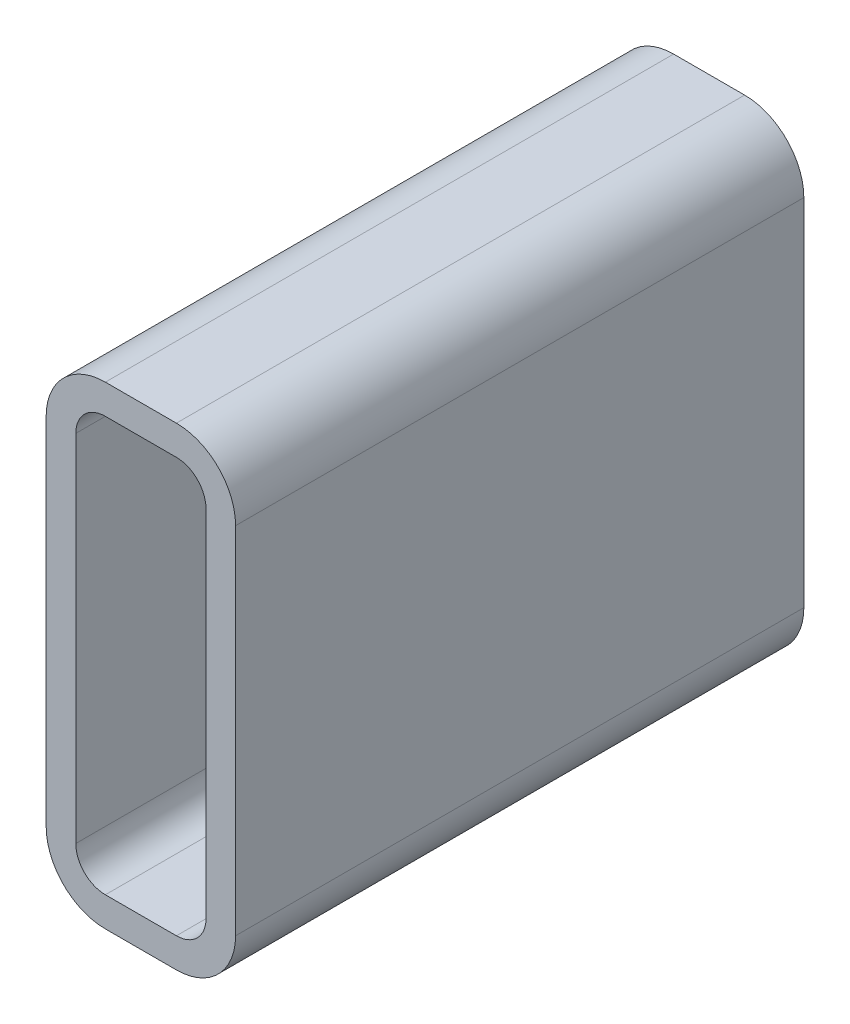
ISO-10303-21;
HEADER;
FILE_DESCRIPTION(('STEP AP214'),'2;1');
FILE_NAME('part.step','',(''),(''),'','','');
FILE_SCHEMA(('AUTOMOTIVE_DESIGN { 1 0 10303 214 1 1 1 1 }'));
ENDSEC;
DATA;
#1=APPLICATION_CONTEXT('core data for automotive mechanical design processes');
#2=APPLICATION_PROTOCOL_DEFINITION('international standard','automotive_design',2000,#1);
#3=PRODUCT_CONTEXT('',#1,'mechanical');
#4=PRODUCT('Part','Part','',(#3));
#5=PRODUCT_RELATED_PRODUCT_CATEGORY('part','',(#4));
#6=PRODUCT_DEFINITION_FORMATION('','',#4);
#7=PRODUCT_DEFINITION_CONTEXT('part definition',#1,'design');
#8=PRODUCT_DEFINITION('design','',#6,#7);
#9=PRODUCT_DEFINITION_SHAPE('','',#8);
#10=(LENGTH_UNIT() NAMED_UNIT(*) SI_UNIT(.MILLI.,.METRE.));
#11=(NAMED_UNIT(*) PLANE_ANGLE_UNIT() SI_UNIT($,.RADIAN.));
#12=(NAMED_UNIT(*) SI_UNIT($,.STERADIAN.) SOLID_ANGLE_UNIT());
#13=UNCERTAINTY_MEASURE_WITH_UNIT(LENGTH_MEASURE(1.E-05),#10,'distance_accuracy_value','');
#14=(GEOMETRIC_REPRESENTATION_CONTEXT(3) GLOBAL_UNCERTAINTY_ASSIGNED_CONTEXT((#13)) GLOBAL_UNIT_ASSIGNED_CONTEXT((#10,
#11,#12)) REPRESENTATION_CONTEXT('',''));
#15=CARTESIAN_POINT('',(0.,0.,0.));
#16=DIRECTION('',(0.,0.,1.));
#17=DIRECTION('',(1.,0.,0.));
#18=AXIS2_PLACEMENT_3D('',#15,#16,#17);
#19=CARTESIAN_POINT('',(33.4251778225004,224.170313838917,304.8));
#20=DIRECTION('',(0.,0.,1.));
#21=DIRECTION('',(1.,0.,0.));
#22=AXIS2_PLACEMENT_3D('',#19,#20,#21);
#23=PLANE('',#22);
#24=CARTESIAN_POINT('',(33.4251778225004,224.170313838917,304.8));
#25=DIRECTION('',(0.,0.,1.));
#26=DIRECTION('',(1.,0.,0.));
#27=AXIS2_PLACEMENT_3D('',#24,#25,#26);
#28=CIRCLE('',#27,31.75);
#29=CARTESIAN_POINT('',(33.4251778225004,255.920313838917,304.8));
#30=VERTEX_POINT('',#29);
#31=CARTESIAN_POINT('',(1.67517782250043,224.170313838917,304.8));
#32=VERTEX_POINT('',#31);
#33=EDGE_CURVE('E211',#30,#32,#28,.T.);
#34=ORIENTED_EDGE('',*,*,#33,.T.);
#35=DIRECTION('',(0.,-1.,0.));
#36=VECTOR('',#35,1.);
#37=CARTESIAN_POINT('',(1.67517782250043,33.6703138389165,304.8));
#38=LINE('',#37,#36);
#39=CARTESIAN_POINT('',(1.67517782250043,33.6703138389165,304.8));
#40=VERTEX_POINT('',#39);
#41=EDGE_CURVE('E214',#32,#40,#38,.T.);
#42=ORIENTED_EDGE('',*,*,#41,.T.);
#43=CARTESIAN_POINT('',(33.4251778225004,33.6703138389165,304.8));
#44=DIRECTION('',(0.,0.,1.));
#45=DIRECTION('',(1.,0.,0.));
#46=AXIS2_PLACEMENT_3D('',#43,#44,#45);
#47=CIRCLE('',#46,31.75);
#48=CARTESIAN_POINT('',(33.4251778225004,1.92031383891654,304.8));
#49=VERTEX_POINT('',#48);
#50=EDGE_CURVE('E217',#40,#49,#47,.T.);
#51=ORIENTED_EDGE('',*,*,#50,.T.);
#52=DIRECTION('',(1.,0.,0.));
#53=VECTOR('',#52,1.);
#54=CARTESIAN_POINT('',(71.5251778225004,1.92031383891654,304.8));
#55=LINE('',#54,#53);
#56=CARTESIAN_POINT('',(71.5251778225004,1.92031383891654,304.8));
#57=VERTEX_POINT('',#56);
#58=EDGE_CURVE('E219',#49,#57,#55,.T.);
#59=ORIENTED_EDGE('',*,*,#58,.T.);
#60=CARTESIAN_POINT('',(71.5251778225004,33.6703138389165,304.8));
#61=DIRECTION('',(0.,0.,1.));
#62=DIRECTION('',(1.,0.,0.));
#63=AXIS2_PLACEMENT_3D('',#60,#61,#62);
#64=CIRCLE('',#63,31.75);
#65=CARTESIAN_POINT('',(103.2751778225,33.6703138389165,304.8));
#66=VERTEX_POINT('',#65);
#67=EDGE_CURVE('E221',#57,#66,#64,.T.);
#68=ORIENTED_EDGE('',*,*,#67,.T.);
#69=DIRECTION('',(0.,1.,0.));
#70=VECTOR('',#69,1.);
#71=CARTESIAN_POINT('',(103.2751778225,224.170313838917,304.8));
#72=LINE('',#71,#70);
#73=CARTESIAN_POINT('',(103.2751778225,224.170313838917,304.8));
#74=VERTEX_POINT('',#73);
#75=EDGE_CURVE('E223',#66,#74,#72,.T.);
#76=ORIENTED_EDGE('',*,*,#75,.T.);
#77=CARTESIAN_POINT('',(71.5251778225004,224.170313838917,304.8));
#78=DIRECTION('',(0.,0.,1.));
#79=DIRECTION('',(1.,0.,0.));
#80=AXIS2_PLACEMENT_3D('',#77,#78,#79);
#81=CIRCLE('',#80,31.75);
#82=CARTESIAN_POINT('',(71.5251778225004,255.920313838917,304.8));
#83=VERTEX_POINT('',#82);
#84=EDGE_CURVE('E225',#74,#83,#81,.T.);
#85=ORIENTED_EDGE('',*,*,#84,.T.);
#86=DIRECTION('',(-1.,0.,0.));
#87=VECTOR('',#86,1.);
#88=CARTESIAN_POINT('',(33.4251778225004,255.920313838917,304.8));
#89=LINE('',#88,#87);
#90=EDGE_CURVE('E227',#83,#30,#89,.T.);
#91=ORIENTED_EDGE('',*,*,#90,.T.);
#92=EDGE_LOOP('',(#34,#42,#51,#59,#68,#76,#85,#91));
#93=FACE_BOUND('',#92,.T.);
#94=DIRECTION('',(0.,-1.,0.));
#95=VECTOR('',#94,1.);
#96=CARTESIAN_POINT('',(17.5501778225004,33.6703138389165,304.8));
#97=LINE('',#96,#95);
#98=CARTESIAN_POINT('',(17.5501778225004,224.170313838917,304.8));
#99=VERTEX_POINT('',#98);
#100=CARTESIAN_POINT('',(17.5501778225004,33.6703138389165,304.8));
#101=VERTEX_POINT('',#100);
#102=EDGE_CURVE('E154',#99,#101,#97,.T.);
#103=ORIENTED_EDGE('',*,*,#102,.F.);
#104=CARTESIAN_POINT('',(33.4251778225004,224.170313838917,304.8));
#105=DIRECTION('',(0.,0.,1.));
#106=DIRECTION('',(1.,0.,0.));
#107=AXIS2_PLACEMENT_3D('',#104,#105,#106);
#108=CIRCLE('',#107,15.875);
#109=CARTESIAN_POINT('',(33.4251778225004,240.045313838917,304.8));
#110=VERTEX_POINT('',#109);
#111=EDGE_CURVE('E146',#110,#99,#108,.T.);
#112=ORIENTED_EDGE('',*,*,#111,.F.);
#113=DIRECTION('',(-1.,0.,0.));
#114=VECTOR('',#113,1.);
#115=CARTESIAN_POINT('',(33.4251778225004,240.045313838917,304.8));
#116=LINE('',#115,#114);
#117=CARTESIAN_POINT('',(71.5251778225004,240.045313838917,304.8));
#118=VERTEX_POINT('',#117);
#119=EDGE_CURVE('E179',#118,#110,#116,.T.);
#120=ORIENTED_EDGE('',*,*,#119,.F.);
#121=CARTESIAN_POINT('',(71.5251778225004,224.170313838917,304.8));
#122=DIRECTION('',(0.,0.,1.));
#123=DIRECTION('',(1.,0.,0.));
#124=AXIS2_PLACEMENT_3D('',#121,#122,#123);
#125=CIRCLE('',#124,15.875);
#126=CARTESIAN_POINT('',(87.4001778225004,224.170313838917,304.8));
#127=VERTEX_POINT('',#126);
#128=EDGE_CURVE('E177',#127,#118,#125,.T.);
#129=ORIENTED_EDGE('',*,*,#128,.F.);
#130=DIRECTION('',(0.,1.,0.));
#131=VECTOR('',#130,1.);
#132=CARTESIAN_POINT('',(87.4001778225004,224.170313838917,304.8));
#133=LINE('',#132,#131);
#134=CARTESIAN_POINT('',(87.4001778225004,33.6703138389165,304.8));
#135=VERTEX_POINT('',#134);
#136=EDGE_CURVE('E175',#135,#127,#133,.T.);
#137=ORIENTED_EDGE('',*,*,#136,.F.);
#138=CARTESIAN_POINT('',(71.5251778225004,33.6703138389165,304.8));
#139=DIRECTION('',(0.,0.,1.));
#140=DIRECTION('',(1.,0.,0.));
#141=AXIS2_PLACEMENT_3D('',#138,#139,#140);
#142=CIRCLE('',#141,15.875);
#143=CARTESIAN_POINT('',(71.5251778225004,17.7953138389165,304.8));
#144=VERTEX_POINT('',#143);
#145=EDGE_CURVE('E173',#144,#135,#142,.T.);
#146=ORIENTED_EDGE('',*,*,#145,.F.);
#147=DIRECTION('',(1.,0.,0.));
#148=VECTOR('',#147,1.);
#149=CARTESIAN_POINT('',(71.5251778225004,17.7953138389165,304.8));
#150=LINE('',#149,#148);
#151=CARTESIAN_POINT('',(33.4251778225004,17.7953138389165,304.8));
#152=VERTEX_POINT('',#151);
#153=EDGE_CURVE('E169',#152,#144,#150,.T.);
#154=ORIENTED_EDGE('',*,*,#153,.F.);
#155=CARTESIAN_POINT('',(33.4251778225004,33.6703138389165,304.8));
#156=DIRECTION('',(0.,0.,1.));
#157=DIRECTION('',(1.,0.,0.));
#158=AXIS2_PLACEMENT_3D('',#155,#156,#157);
#159=CIRCLE('',#158,15.875);
#160=EDGE_CURVE('E167',#101,#152,#159,.T.);
#161=ORIENTED_EDGE('',*,*,#160,.F.);
#162=EDGE_LOOP('',(#103,#112,#120,#129,#137,#146,#154,#161));
#163=FACE_BOUND('',#162,.T.);
#164=ADVANCED_FACE('F33',(#93,#163),#23,.T.);
#165=CARTESIAN_POINT('',(33.4251778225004,224.170313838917,0.));
#166=DIRECTION('',(0.,0.,1.));
#167=DIRECTION('',(1.,0.,0.));
#168=AXIS2_PLACEMENT_3D('',#165,#166,#167);
#169=PLANE('',#168);
#170=CARTESIAN_POINT('',(33.4251778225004,224.170313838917,0.));
#171=DIRECTION('',(0.,0.,1.));
#172=DIRECTION('',(1.,0.,0.));
#173=AXIS2_PLACEMENT_3D('',#170,#171,#172);
#174=CIRCLE('',#173,31.75);
#175=CARTESIAN_POINT('',(33.4251778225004,255.920313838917,0.));
#176=VERTEX_POINT('',#175);
#177=CARTESIAN_POINT('',(1.67517782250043,224.170313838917,0.));
#178=VERTEX_POINT('',#177);
#179=EDGE_CURVE('E162',#176,#178,#174,.T.);
#180=ORIENTED_EDGE('',*,*,#179,.F.);
#181=DIRECTION('',(-1.,0.,0.));
#182=VECTOR('',#181,1.);
#183=CARTESIAN_POINT('',(33.4251778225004,255.920313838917,0.));
#184=LINE('',#183,#182);
#185=CARTESIAN_POINT('',(71.5251778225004,255.920313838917,0.));
#186=VERTEX_POINT('',#185);
#187=EDGE_CURVE('E215',#186,#176,#184,.T.);
#188=ORIENTED_EDGE('',*,*,#187,.F.);
#189=CARTESIAN_POINT('',(71.5251778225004,224.170313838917,0.));
#190=DIRECTION('',(0.,0.,1.));
#191=DIRECTION('',(1.,0.,0.));
#192=AXIS2_PLACEMENT_3D('',#189,#190,#191);
#193=CIRCLE('',#192,31.75);
#194=CARTESIAN_POINT('',(103.2751778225,224.170313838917,0.));
#195=VERTEX_POINT('',#194);
#196=EDGE_CURVE('E242',#195,#186,#193,.T.);
#197=ORIENTED_EDGE('',*,*,#196,.F.);
#198=DIRECTION('',(0.,1.,0.));
#199=VECTOR('',#198,1.);
#200=CARTESIAN_POINT('',(103.2751778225,224.170313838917,0.));
#201=LINE('',#200,#199);
#202=CARTESIAN_POINT('',(103.2751778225,33.6703138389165,0.));
#203=VERTEX_POINT('',#202);
#204=EDGE_CURVE('E240',#203,#195,#201,.T.);
#205=ORIENTED_EDGE('',*,*,#204,.F.);
#206=CARTESIAN_POINT('',(71.5251778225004,33.6703138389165,0.));
#207=DIRECTION('',(0.,0.,1.));
#208=DIRECTION('',(1.,0.,0.));
#209=AXIS2_PLACEMENT_3D('',#206,#207,#208);
#210=CIRCLE('',#209,31.75);
#211=CARTESIAN_POINT('',(71.5251778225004,1.92031383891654,0.));
#212=VERTEX_POINT('',#211);
#213=EDGE_CURVE('E238',#212,#203,#210,.T.);
#214=ORIENTED_EDGE('',*,*,#213,.F.);
#215=DIRECTION('',(1.,0.,0.));
#216=VECTOR('',#215,1.);
#217=CARTESIAN_POINT('',(71.5251778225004,1.92031383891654,0.));
#218=LINE('',#217,#216);
#219=CARTESIAN_POINT('',(33.4251778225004,1.92031383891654,0.));
#220=VERTEX_POINT('',#219);
#221=EDGE_CURVE('E236',#220,#212,#218,.T.);
#222=ORIENTED_EDGE('',*,*,#221,.F.);
#223=CARTESIAN_POINT('',(33.4251778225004,33.6703138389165,0.));
#224=DIRECTION('',(0.,0.,1.));
#225=DIRECTION('',(1.,0.,0.));
#226=AXIS2_PLACEMENT_3D('',#223,#224,#225);
#227=CIRCLE('',#226,31.75);
#228=CARTESIAN_POINT('',(1.67517782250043,33.6703138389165,0.));
#229=VERTEX_POINT('',#228);
#230=EDGE_CURVE('E234',#229,#220,#227,.T.);
#231=ORIENTED_EDGE('',*,*,#230,.F.);
#232=DIRECTION('',(0.,-1.,0.));
#233=VECTOR('',#232,1.);
#234=CARTESIAN_POINT('',(1.67517782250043,33.6703138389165,0.));
#235=LINE('',#234,#233);
#236=EDGE_CURVE('E232',#178,#229,#235,.T.);
#237=ORIENTED_EDGE('',*,*,#236,.F.);
#238=EDGE_LOOP('',(#180,#188,#197,#205,#214,#222,#231,#237));
#239=FACE_BOUND('',#238,.T.);
#240=CARTESIAN_POINT('',(33.4251778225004,224.170313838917,0.));
#241=DIRECTION('',(0.,0.,1.));
#242=DIRECTION('',(1.,0.,0.));
#243=AXIS2_PLACEMENT_3D('',#240,#241,#242);
#244=CIRCLE('',#243,15.875);
#245=CARTESIAN_POINT('',(33.4251778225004,240.045313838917,0.));
#246=VERTEX_POINT('',#245);
#247=CARTESIAN_POINT('',(17.5501778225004,224.170313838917,0.));
#248=VERTEX_POINT('',#247);
#249=EDGE_CURVE('E56',#246,#248,#244,.T.);
#250=ORIENTED_EDGE('',*,*,#249,.T.);
#251=DIRECTION('',(0.,-1.,0.));
#252=VECTOR('',#251,1.);
#253=CARTESIAN_POINT('',(17.5501778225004,33.6703138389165,0.));
#254=LINE('',#253,#252);
#255=CARTESIAN_POINT('',(17.5501778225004,33.6703138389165,0.));
#256=VERTEX_POINT('',#255);
#257=EDGE_CURVE('E161',#248,#256,#254,.T.);
#258=ORIENTED_EDGE('',*,*,#257,.T.);
#259=CARTESIAN_POINT('',(33.4251778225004,33.6703138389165,0.));
#260=DIRECTION('',(0.,0.,1.));
#261=DIRECTION('',(1.,0.,0.));
#262=AXIS2_PLACEMENT_3D('',#259,#260,#261);
#263=CIRCLE('',#262,15.875);
#264=CARTESIAN_POINT('',(33.4251778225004,17.7953138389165,0.));
#265=VERTEX_POINT('',#264);
#266=EDGE_CURVE('E183',#256,#265,#263,.T.);
#267=ORIENTED_EDGE('',*,*,#266,.T.);
#268=DIRECTION('',(1.,0.,0.));
#269=VECTOR('',#268,1.);
#270=CARTESIAN_POINT('',(71.5251778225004,17.7953138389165,0.));
#271=LINE('',#270,#269);
#272=CARTESIAN_POINT('',(71.5251778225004,17.7953138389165,0.));
#273=VERTEX_POINT('',#272);
#274=EDGE_CURVE('E186',#265,#273,#271,.T.);
#275=ORIENTED_EDGE('',*,*,#274,.T.);
#276=CARTESIAN_POINT('',(71.5251778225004,33.6703138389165,0.));
#277=DIRECTION('',(0.,0.,1.));
#278=DIRECTION('',(1.,0.,0.));
#279=AXIS2_PLACEMENT_3D('',#276,#277,#278);
#280=CIRCLE('',#279,15.875);
#281=CARTESIAN_POINT('',(87.4001778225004,33.6703138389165,0.));
#282=VERTEX_POINT('',#281);
#283=EDGE_CURVE('E189',#273,#282,#280,.T.);
#284=ORIENTED_EDGE('',*,*,#283,.T.);
#285=DIRECTION('',(0.,1.,0.));
#286=VECTOR('',#285,1.);
#287=CARTESIAN_POINT('',(87.4001778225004,224.170313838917,0.));
#288=LINE('',#287,#286);
#289=CARTESIAN_POINT('',(87.4001778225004,224.170313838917,0.));
#290=VERTEX_POINT('',#289);
#291=EDGE_CURVE('E192',#282,#290,#288,.T.);
#292=ORIENTED_EDGE('',*,*,#291,.T.);
#293=CARTESIAN_POINT('',(71.5251778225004,224.170313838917,0.));
#294=DIRECTION('',(0.,0.,1.));
#295=DIRECTION('',(1.,0.,0.));
#296=AXIS2_PLACEMENT_3D('',#293,#294,#295);
#297=CIRCLE('',#296,15.875);
#298=CARTESIAN_POINT('',(71.5251778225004,240.045313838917,0.));
#299=VERTEX_POINT('',#298);
#300=EDGE_CURVE('E195',#290,#299,#297,.T.);
#301=ORIENTED_EDGE('',*,*,#300,.T.);
#302=DIRECTION('',(-1.,0.,0.));
#303=VECTOR('',#302,1.);
#304=CARTESIAN_POINT('',(33.4251778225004,240.045313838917,0.));
#305=LINE('',#304,#303);
#306=EDGE_CURVE('E155',#299,#246,#305,.T.);
#307=ORIENTED_EDGE('',*,*,#306,.T.);
#308=EDGE_LOOP('',(#250,#258,#267,#275,#284,#292,#301,#307));
#309=FACE_BOUND('',#308,.T.);
#310=ADVANCED_FACE('F272',(#239,#309),#169,.F.);
#311=CARTESIAN_POINT('',(33.4251778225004,224.170313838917,304.8));
#312=DIRECTION('',(0.,0.,-1.));
#313=DIRECTION('',(-1.,0.,0.));
#314=AXIS2_PLACEMENT_3D('',#311,#312,#313);
#315=CYLINDRICAL_SURFACE('',#314,31.75);
#316=ORIENTED_EDGE('',*,*,#179,.T.);
#317=DIRECTION('',(0.,0.,-1.));
#318=VECTOR('',#317,1.);
#319=CARTESIAN_POINT('',(1.67517782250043,224.170313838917,304.8));
#320=LINE('',#319,#318);
#321=EDGE_CURVE('E11',#32,#178,#320,.T.);
#322=ORIENTED_EDGE('',*,*,#321,.F.);
#323=ORIENTED_EDGE('',*,*,#33,.F.);
#324=DIRECTION('',(0.,0.,-1.));
#325=VECTOR('',#324,1.);
#326=CARTESIAN_POINT('',(33.4251778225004,255.920313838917,304.8));
#327=LINE('',#326,#325);
#328=EDGE_CURVE('E229',#30,#176,#327,.T.);
#329=ORIENTED_EDGE('',*,*,#328,.T.);
#330=EDGE_LOOP('',(#316,#322,#323,#329));
#331=FACE_BOUND('',#330,.T.);
#332=ADVANCED_FACE('F35',(#331),#315,.T.);
#333=CARTESIAN_POINT('',(1.67517782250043,33.6703138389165,304.8));
#334=DIRECTION('',(1.,0.,0.));
#335=DIRECTION('',(0.,0.,-1.));
#336=AXIS2_PLACEMENT_3D('',#333,#334,#335);
#337=PLANE('',#336);
#338=ORIENTED_EDGE('',*,*,#236,.T.);
#339=DIRECTION('',(0.,0.,-1.));
#340=VECTOR('',#339,1.);
#341=CARTESIAN_POINT('',(1.67517782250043,33.6703138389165,304.8));
#342=LINE('',#341,#340);
#343=EDGE_CURVE('E41',#40,#229,#342,.T.);
#344=ORIENTED_EDGE('',*,*,#343,.F.);
#345=ORIENTED_EDGE('',*,*,#41,.F.);
#346=ORIENTED_EDGE('',*,*,#321,.T.);
#347=EDGE_LOOP('',(#338,#344,#345,#346));
#348=FACE_BOUND('',#347,.T.);
#349=ADVANCED_FACE('F289',(#348),#337,.F.);
#350=CARTESIAN_POINT('',(33.4251778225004,33.6703138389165,304.8));
#351=DIRECTION('',(0.,0.,-1.));
#352=DIRECTION('',(-1.,0.,0.));
#353=AXIS2_PLACEMENT_3D('',#350,#351,#352);
#354=CYLINDRICAL_SURFACE('',#353,31.75);
#355=ORIENTED_EDGE('',*,*,#230,.T.);
#356=DIRECTION('',(0.,0.,-1.));
#357=VECTOR('',#356,1.);
#358=CARTESIAN_POINT('',(33.4251778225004,1.92031383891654,304.8));
#359=LINE('',#358,#357);
#360=EDGE_CURVE('E259',#49,#220,#359,.T.);
#361=ORIENTED_EDGE('',*,*,#360,.F.);
#362=ORIENTED_EDGE('',*,*,#50,.F.);
#363=ORIENTED_EDGE('',*,*,#343,.T.);
#364=EDGE_LOOP('',(#355,#361,#362,#363));
#365=FACE_BOUND('',#364,.T.);
#366=ADVANCED_FACE('F266',(#365),#354,.T.);
#367=CARTESIAN_POINT('',(71.5251778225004,1.92031383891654,304.8));
#368=DIRECTION('',(0.,1.,0.));
#369=DIRECTION('',(0.,0.,1.));
#370=AXIS2_PLACEMENT_3D('',#367,#368,#369);
#371=PLANE('',#370);
#372=ORIENTED_EDGE('',*,*,#221,.T.);
#373=DIRECTION('',(0.,0.,-1.));
#374=VECTOR('',#373,1.);
#375=CARTESIAN_POINT('',(71.5251778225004,1.92031383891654,304.8));
#376=LINE('',#375,#374);
#377=EDGE_CURVE('E256',#57,#212,#376,.T.);
#378=ORIENTED_EDGE('',*,*,#377,.F.);
#379=ORIENTED_EDGE('',*,*,#58,.F.);
#380=ORIENTED_EDGE('',*,*,#360,.T.);
#381=EDGE_LOOP('',(#372,#378,#379,#380));
#382=FACE_BOUND('',#381,.T.);
#383=ADVANCED_FACE('F278',(#382),#371,.F.);
#384=CARTESIAN_POINT('',(71.5251778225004,33.6703138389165,304.8));
#385=DIRECTION('',(0.,0.,-1.));
#386=DIRECTION('',(-1.,0.,0.));
#387=AXIS2_PLACEMENT_3D('',#384,#385,#386);
#388=CYLINDRICAL_SURFACE('',#387,31.75);
#389=ORIENTED_EDGE('',*,*,#213,.T.);
#390=DIRECTION('',(0.,0.,-1.));
#391=VECTOR('',#390,1.);
#392=CARTESIAN_POINT('',(103.2751778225,33.6703138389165,304.8));
#393=LINE('',#392,#391);
#394=EDGE_CURVE('E253',#66,#203,#393,.T.);
#395=ORIENTED_EDGE('',*,*,#394,.F.);
#396=ORIENTED_EDGE('',*,*,#67,.F.);
#397=ORIENTED_EDGE('',*,*,#377,.T.);
#398=EDGE_LOOP('',(#389,#395,#396,#397));
#399=FACE_BOUND('',#398,.T.);
#400=ADVANCED_FACE('F282',(#399),#388,.T.);
#401=CARTESIAN_POINT('',(103.2751778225,224.170313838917,304.8));
#402=DIRECTION('',(-1.,0.,0.));
#403=DIRECTION('',(0.,0.,1.));
#404=AXIS2_PLACEMENT_3D('',#401,#402,#403);
#405=PLANE('',#404);
#406=ORIENTED_EDGE('',*,*,#204,.T.);
#407=DIRECTION('',(0.,0.,-1.));
#408=VECTOR('',#407,1.);
#409=CARTESIAN_POINT('',(103.2751778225,224.170313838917,304.8));
#410=LINE('',#409,#408);
#411=EDGE_CURVE('E250',#74,#195,#410,.T.);
#412=ORIENTED_EDGE('',*,*,#411,.F.);
#413=ORIENTED_EDGE('',*,*,#75,.F.);
#414=ORIENTED_EDGE('',*,*,#394,.T.);
#415=EDGE_LOOP('',(#406,#412,#413,#414));
#416=FACE_BOUND('',#415,.T.);
#417=ADVANCED_FACE('F302',(#416),#405,.F.);
#418=CARTESIAN_POINT('',(71.5251778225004,224.170313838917,304.8));
#419=DIRECTION('',(0.,0.,-1.));
#420=DIRECTION('',(-1.,0.,0.));
#421=AXIS2_PLACEMENT_3D('',#418,#419,#420);
#422=CYLINDRICAL_SURFACE('',#421,31.75);
#423=ORIENTED_EDGE('',*,*,#196,.T.);
#424=DIRECTION('',(0.,0.,-1.));
#425=VECTOR('',#424,1.);
#426=CARTESIAN_POINT('',(71.5251778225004,255.920313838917,304.8));
#427=LINE('',#426,#425);
#428=EDGE_CURVE('E247',#83,#186,#427,.T.);
#429=ORIENTED_EDGE('',*,*,#428,.F.);
#430=ORIENTED_EDGE('',*,*,#84,.F.);
#431=ORIENTED_EDGE('',*,*,#411,.T.);
#432=EDGE_LOOP('',(#423,#429,#430,#431));
#433=FACE_BOUND('',#432,.T.);
#434=ADVANCED_FACE('F300',(#433),#422,.T.);
#435=CARTESIAN_POINT('',(33.4251778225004,255.920313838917,304.8));
#436=DIRECTION('',(0.,-1.,0.));
#437=DIRECTION('',(0.,0.,-1.));
#438=AXIS2_PLACEMENT_3D('',#435,#436,#437);
#439=PLANE('',#438);
#440=ORIENTED_EDGE('',*,*,#187,.T.);
#441=ORIENTED_EDGE('',*,*,#328,.F.);
#442=ORIENTED_EDGE('',*,*,#90,.F.);
#443=ORIENTED_EDGE('',*,*,#428,.T.);
#444=EDGE_LOOP('',(#440,#441,#442,#443));
#445=FACE_BOUND('',#444,.T.);
#446=ADVANCED_FACE('F295',(#445),#439,.F.);
#447=CARTESIAN_POINT('',(33.4251778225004,224.170313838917,304.8));
#448=DIRECTION('',(0.,0.,-1.));
#449=DIRECTION('',(-1.,0.,0.));
#450=AXIS2_PLACEMENT_3D('',#447,#448,#449);
#451=CYLINDRICAL_SURFACE('',#450,15.875);
#452=ORIENTED_EDGE('',*,*,#249,.F.);
#453=DIRECTION('',(0.,0.,-1.));
#454=VECTOR('',#453,1.);
#455=CARTESIAN_POINT('',(33.4251778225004,240.045313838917,304.8));
#456=LINE('',#455,#454);
#457=EDGE_CURVE('E150',#110,#246,#456,.T.);
#458=ORIENTED_EDGE('',*,*,#457,.F.);
#459=ORIENTED_EDGE('',*,*,#111,.T.);
#460=DIRECTION('',(0.,0.,-1.));
#461=VECTOR('',#460,1.);
#462=CARTESIAN_POINT('',(17.5501778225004,224.170313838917,304.8));
#463=LINE('',#462,#461);
#464=EDGE_CURVE('E149',#99,#248,#463,.T.);
#465=ORIENTED_EDGE('',*,*,#464,.T.);
#466=EDGE_LOOP('',(#452,#458,#459,#465));
#467=FACE_BOUND('',#466,.T.);
#468=ADVANCED_FACE('F148',(#467),#451,.F.);
#469=CARTESIAN_POINT('',(17.5501778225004,33.6703138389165,304.8));
#470=DIRECTION('',(1.,0.,0.));
#471=DIRECTION('',(0.,0.,-1.));
#472=AXIS2_PLACEMENT_3D('',#469,#470,#471);
#473=PLANE('',#472);
#474=ORIENTED_EDGE('',*,*,#257,.F.);
#475=ORIENTED_EDGE('',*,*,#464,.F.);
#476=ORIENTED_EDGE('',*,*,#102,.T.);
#477=DIRECTION('',(0.,0.,-1.));
#478=VECTOR('',#477,1.);
#479=CARTESIAN_POINT('',(17.5501778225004,33.6703138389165,304.8));
#480=LINE('',#479,#478);
#481=EDGE_CURVE('E163',#101,#256,#480,.T.);
#482=ORIENTED_EDGE('',*,*,#481,.T.);
#483=EDGE_LOOP('',(#474,#475,#476,#482));
#484=FACE_BOUND('',#483,.T.);
#485=ADVANCED_FACE('F158',(#484),#473,.T.);
#486=CARTESIAN_POINT('',(33.4251778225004,33.6703138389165,304.8));
#487=DIRECTION('',(0.,0.,-1.));
#488=DIRECTION('',(-1.,0.,0.));
#489=AXIS2_PLACEMENT_3D('',#486,#487,#488);
#490=CYLINDRICAL_SURFACE('',#489,15.875);
#491=ORIENTED_EDGE('',*,*,#266,.F.);
#492=ORIENTED_EDGE('',*,*,#481,.F.);
#493=ORIENTED_EDGE('',*,*,#160,.T.);
#494=DIRECTION('',(0.,0.,-1.));
#495=VECTOR('',#494,1.);
#496=CARTESIAN_POINT('',(33.4251778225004,17.7953138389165,304.8));
#497=LINE('',#496,#495);
#498=EDGE_CURVE('E208',#152,#265,#497,.T.);
#499=ORIENTED_EDGE('',*,*,#498,.T.);
#500=EDGE_LOOP('',(#491,#492,#493,#499));
#501=FACE_BOUND('',#500,.T.);
#502=ADVANCED_FACE('F327',(#501),#490,.F.);
#503=CARTESIAN_POINT('',(71.5251778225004,17.7953138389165,304.8));
#504=DIRECTION('',(0.,1.,0.));
#505=DIRECTION('',(0.,0.,1.));
#506=AXIS2_PLACEMENT_3D('',#503,#504,#505);
#507=PLANE('',#506);
#508=ORIENTED_EDGE('',*,*,#274,.F.);
#509=ORIENTED_EDGE('',*,*,#498,.F.);
#510=ORIENTED_EDGE('',*,*,#153,.T.);
#511=DIRECTION('',(0.,0.,-1.));
#512=VECTOR('',#511,1.);
#513=CARTESIAN_POINT('',(71.5251778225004,17.7953138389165,304.8));
#514=LINE('',#513,#512);
#515=EDGE_CURVE('E206',#144,#273,#514,.T.);
#516=ORIENTED_EDGE('',*,*,#515,.T.);
#517=EDGE_LOOP('',(#508,#509,#510,#516));
#518=FACE_BOUND('',#517,.T.);
#519=ADVANCED_FACE('F331',(#518),#507,.T.);
#520=CARTESIAN_POINT('',(71.5251778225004,33.6703138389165,304.8));
#521=DIRECTION('',(0.,0.,-1.));
#522=DIRECTION('',(-1.,0.,0.));
#523=AXIS2_PLACEMENT_3D('',#520,#521,#522);
#524=CYLINDRICAL_SURFACE('',#523,15.875);
#525=ORIENTED_EDGE('',*,*,#283,.F.);
#526=ORIENTED_EDGE('',*,*,#515,.F.);
#527=ORIENTED_EDGE('',*,*,#145,.T.);
#528=DIRECTION('',(0.,0.,-1.));
#529=VECTOR('',#528,1.);
#530=CARTESIAN_POINT('',(87.4001778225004,33.6703138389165,304.8));
#531=LINE('',#530,#529);
#532=EDGE_CURVE('E204',#135,#282,#531,.T.);
#533=ORIENTED_EDGE('',*,*,#532,.T.);
#534=EDGE_LOOP('',(#525,#526,#527,#533));
#535=FACE_BOUND('',#534,.T.);
#536=ADVANCED_FACE('F337',(#535),#524,.F.);
#537=CARTESIAN_POINT('',(87.4001778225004,224.170313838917,304.8));
#538=DIRECTION('',(-1.,0.,0.));
#539=DIRECTION('',(0.,0.,1.));
#540=AXIS2_PLACEMENT_3D('',#537,#538,#539);
#541=PLANE('',#540);
#542=ORIENTED_EDGE('',*,*,#291,.F.);
#543=ORIENTED_EDGE('',*,*,#532,.F.);
#544=ORIENTED_EDGE('',*,*,#136,.T.);
#545=DIRECTION('',(0.,0.,-1.));
#546=VECTOR('',#545,1.);
#547=CARTESIAN_POINT('',(87.4001778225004,224.170313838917,304.8));
#548=LINE('',#547,#546);
#549=EDGE_CURVE('E202',#127,#290,#548,.T.);
#550=ORIENTED_EDGE('',*,*,#549,.T.);
#551=EDGE_LOOP('',(#542,#543,#544,#550));
#552=FACE_BOUND('',#551,.T.);
#553=ADVANCED_FACE('F341',(#552),#541,.T.);
#554=CARTESIAN_POINT('',(71.5251778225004,224.170313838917,304.8));
#555=DIRECTION('',(0.,0.,-1.));
#556=DIRECTION('',(-1.,0.,0.));
#557=AXIS2_PLACEMENT_3D('',#554,#555,#556);
#558=CYLINDRICAL_SURFACE('',#557,15.875);
#559=ORIENTED_EDGE('',*,*,#300,.F.);
#560=ORIENTED_EDGE('',*,*,#549,.F.);
#561=ORIENTED_EDGE('',*,*,#128,.T.);
#562=DIRECTION('',(0.,0.,-1.));
#563=VECTOR('',#562,1.);
#564=CARTESIAN_POINT('',(71.5251778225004,240.045313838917,304.8));
#565=LINE('',#564,#563);
#566=EDGE_CURVE('E48',#118,#299,#565,.T.);
#567=ORIENTED_EDGE('',*,*,#566,.T.);
#568=EDGE_LOOP('',(#559,#560,#561,#567));
#569=FACE_BOUND('',#568,.T.);
#570=ADVANCED_FACE('F345',(#569),#558,.F.);
#571=CARTESIAN_POINT('',(33.4251778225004,240.045313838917,304.8));
#572=DIRECTION('',(0.,-1.,0.));
#573=DIRECTION('',(0.,0.,-1.));
#574=AXIS2_PLACEMENT_3D('',#571,#572,#573);
#575=PLANE('',#574);
#576=ORIENTED_EDGE('',*,*,#306,.F.);
#577=ORIENTED_EDGE('',*,*,#566,.F.);
#578=ORIENTED_EDGE('',*,*,#119,.T.);
#579=ORIENTED_EDGE('',*,*,#457,.T.);
#580=EDGE_LOOP('',(#576,#577,#578,#579));
#581=FACE_BOUND('',#580,.T.);
#582=ADVANCED_FACE('F349',(#581),#575,.T.);
#583=CLOSED_SHELL('',(#164,#310,#332,#349,#366,#383,#400,#417,#434,#446,#468,#485,#502,#519,
#536,#553,#570,#582));
#584=MANIFOLD_SOLID_BREP('B2',#583);
#585=ADVANCED_BREP_SHAPE_REPRESENTATION('',(#18,#584),#14);
#586=SHAPE_DEFINITION_REPRESENTATION(#9,#585);
ENDSEC;
END-ISO-10303-21;
